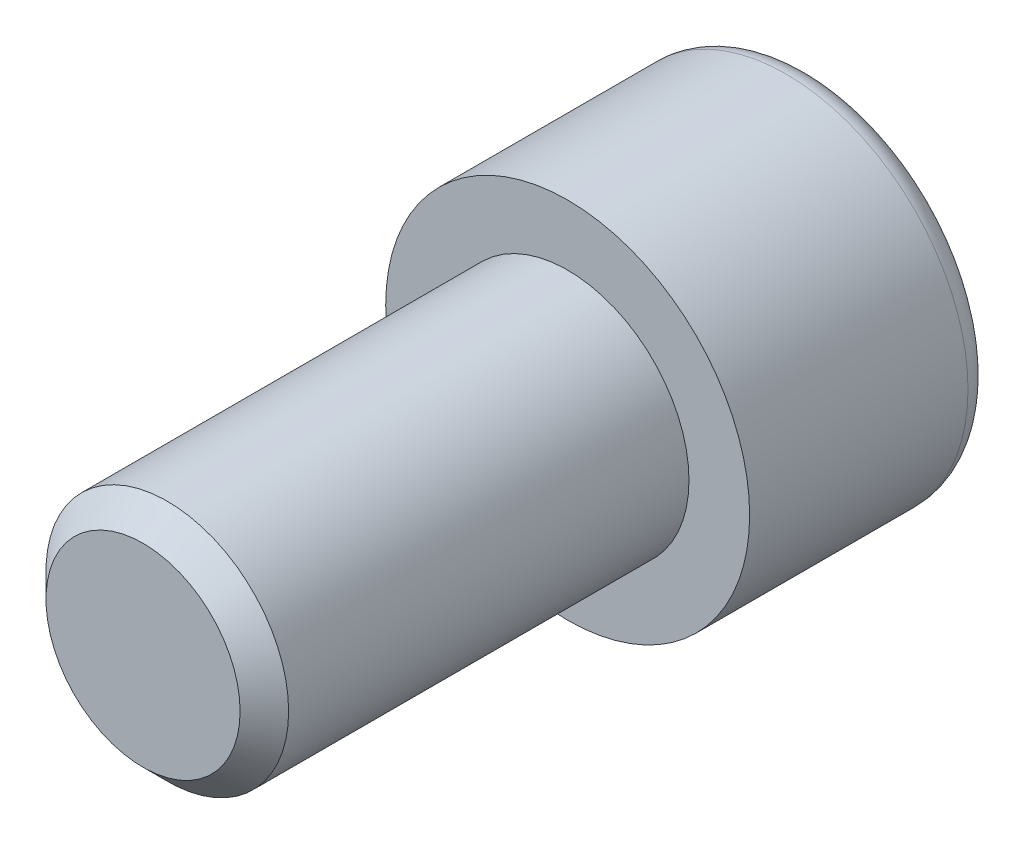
from build123d import *

# Parameters (mm, degrees)
ENLEV_MAT_EXTRU1_DEPTH = 8
ESQUISSE3_W            = 8
ESQUISSE3_H            = 28
CHANFREIN1_SIZE        = 1.6


with BuildPart() as part:
    # Esquisse1 → Base-R_volution (revolve)
    with BuildSketch(Plane(origin=(0, 0, 0), x_dir=(1, 0, 0), z_dir=(0, 1, 0)), mode=Mode.PRIVATE) as base_r_volution_sk:
        with BuildLine():
            Line((0, 0), (12, 0))
            Line((12, 0), (12, 14.4))
            ThreePointArc((12, 14.4), (11.53137085, 15.53137085), (10.4, 16))
            Line((10.4, 16), (0, 16))
            Line((0, 16), (0, 0))
        make_face()
    revolve(base_r_volution_sk.sketch.rotate(Axis((0, 0, 0), (0, 0, -1)), 180), axis=Axis((0, 0, 0), (0, 0, -1)))

    # Esquisse2 → enlev-mat-Extru1 (cut)
    with BuildSketch(Plane.XY.offset(-16)):
        Polygon((7, -4.041451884), (7, 4.041451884), (0, 8.082903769), (-7, 4.041451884), (-7, -4.041451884), (0, -8.082903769), align=None)
    extrude(amount=ENLEV_MAT_EXTRU1_DEPTH, mode=Mode.SUBTRACT)

    # Esquisse3 → Boss.-R_vol.1 (revolve)
    with BuildSketch(Plane(origin=(0, 0, 0), x_dir=(1, 0, 0), z_dir=(0, 1, 0))):
        with Locations((4, -14)):
            Rectangle(ESQUISSE3_W, ESQUISSE3_H)
    revolve(axis=Axis((0, 0, 0), (0, 0, 1)))

    # Chanfrein1
    chanfrein1_edges = [part.edges().sort_by_distance(p)[0] for p in [
        (-8, 0, 28),
    ]]
    chamfer(chanfrein1_edges, length=CHANFREIN1_SIZE)


solid = part.part
